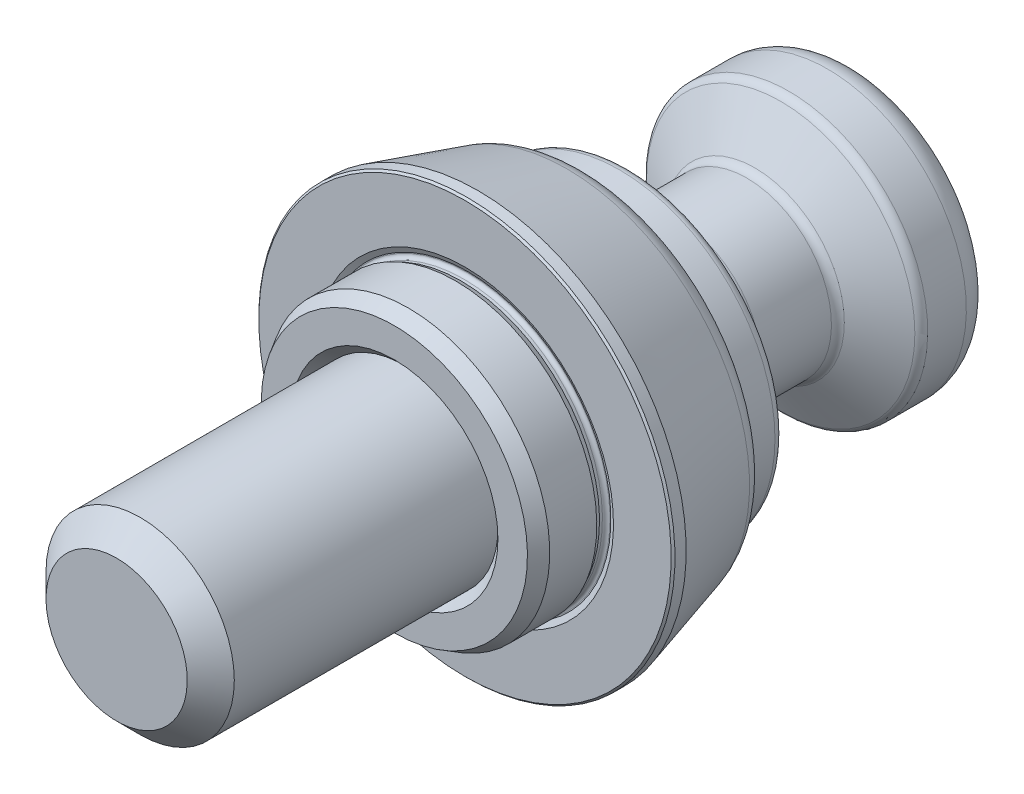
ISO-10303-21;
HEADER;
FILE_DESCRIPTION(('STEP AP214'),'2;1');
FILE_NAME('part.step','',(''),(''),'','','');
FILE_SCHEMA(('AUTOMOTIVE_DESIGN { 1 0 10303 214 1 1 1 1 }'));
ENDSEC;
DATA;
#1=APPLICATION_CONTEXT('core data for automotive mechanical design processes');
#2=APPLICATION_PROTOCOL_DEFINITION('international standard','automotive_design',2000,#1);
#3=PRODUCT_CONTEXT('',#1,'mechanical');
#4=PRODUCT('Part','Part','',(#3));
#5=PRODUCT_RELATED_PRODUCT_CATEGORY('part','',(#4));
#6=PRODUCT_DEFINITION_FORMATION('','',#4);
#7=PRODUCT_DEFINITION_CONTEXT('part definition',#1,'design');
#8=PRODUCT_DEFINITION('design','',#6,#7);
#9=PRODUCT_DEFINITION_SHAPE('','',#8);
#10=(LENGTH_UNIT() NAMED_UNIT(*) SI_UNIT(.MILLI.,.METRE.));
#11=(NAMED_UNIT(*) PLANE_ANGLE_UNIT() SI_UNIT($,.RADIAN.));
#12=(NAMED_UNIT(*) SI_UNIT($,.STERADIAN.) SOLID_ANGLE_UNIT());
#13=UNCERTAINTY_MEASURE_WITH_UNIT(LENGTH_MEASURE(1.E-05),#10,'distance_accuracy_value','');
#14=(GEOMETRIC_REPRESENTATION_CONTEXT(3) GLOBAL_UNCERTAINTY_ASSIGNED_CONTEXT((#13)) GLOBAL_UNIT_ASSIGNED_CONTEXT((#10,
#11,#12)) REPRESENTATION_CONTEXT('',''));
#15=CARTESIAN_POINT('',(0.,0.,0.));
#16=DIRECTION('',(0.,0.,1.));
#17=DIRECTION('',(1.,0.,0.));
#18=AXIS2_PLACEMENT_3D('',#15,#16,#17);
#19=CARTESIAN_POINT('',(15.1,0.,-0.3));
#20=DIRECTION('',(0.,0.,-1.));
#21=DIRECTION('',(0.,1.,0.));
#22=AXIS2_PLACEMENT_3D('',#19,#20,#21);
#23=PLANE('',#22);
#24=CARTESIAN_POINT('',(0.,0.,-0.3));
#25=DIRECTION('',(0.,0.,-1.));
#26=DIRECTION('',(0.,1.,0.));
#27=AXIS2_PLACEMENT_3D('',#24,#25,#26);
#28=CIRCLE('',#27,15.1978793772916);
#29=CARTESIAN_POINT('',(0.,15.1978793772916,-0.3));
#30=VERTEX_POINT('',#29);
#31=EDGE_CURVE('E582',#30,#30,#28,.T.);
#32=ORIENTED_EDGE('',*,*,#31,.F.);
#33=EDGE_LOOP('',(#32));
#34=FACE_BOUND('',#33,.T.);
#35=CARTESIAN_POINT('',(0.,0.,-0.3));
#36=DIRECTION('',(0.,0.,-1.));
#37=DIRECTION('',(0.,1.,0.));
#38=AXIS2_PLACEMENT_3D('',#35,#36,#37);
#39=CIRCLE('',#38,15.1);
#40=CARTESIAN_POINT('',(0.,15.1,-0.3));
#41=VERTEX_POINT('',#40);
#42=EDGE_CURVE('E585',#41,#41,#39,.T.);
#43=ORIENTED_EDGE('',*,*,#42,.T.);
#44=EDGE_LOOP('',(#43));
#45=FACE_BOUND('',#44,.T.);
#46=ADVANCED_FACE('F14',(#34,#45),#23,.F.);
#47=CARTESIAN_POINT('',(0.,0.,0.1));
#48=DIRECTION('',(0.,0.,-1.));
#49=DIRECTION('',(0.,1.,0.));
#50=AXIS2_PLACEMENT_3D('',#47,#48,#49);
#51=TOROIDAL_SURFACE('',#50,15.1,0.4);
#52=ORIENTED_EDGE('',*,*,#42,.F.);
#53=EDGE_LOOP('',(#52));
#54=FACE_BOUND('',#53,.T.);
#55=CARTESIAN_POINT('',(0.,0.,0.1));
#56=DIRECTION('',(0.,0.,-1.));
#57=DIRECTION('',(0.,1.,0.));
#58=AXIS2_PLACEMENT_3D('',#55,#56,#57);
#59=CIRCLE('',#58,14.7);
#60=CARTESIAN_POINT('',(0.,14.7,0.1));
#61=VERTEX_POINT('',#60);
#62=EDGE_CURVE('E586',#61,#61,#59,.T.);
#63=ORIENTED_EDGE('',*,*,#62,.T.);
#64=EDGE_LOOP('',(#63));
#65=FACE_BOUND('',#64,.T.);
#66=ADVANCED_FACE('F543',(#54,#65),#51,.F.);
#67=CARTESIAN_POINT('',(0.,0.,0.));
#68=DIRECTION('',(0.,0.,-1.));
#69=DIRECTION('',(0.,1.,0.));
#70=AXIS2_PLACEMENT_3D('',#67,#68,#69);
#71=CYLINDRICAL_SURFACE('',#70,14.7);
#72=ORIENTED_EDGE('',*,*,#62,.F.);
#73=EDGE_LOOP('',(#72));
#74=FACE_BOUND('',#73,.T.);
#75=CARTESIAN_POINT('',(0.,0.,0.411216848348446));
#76=DIRECTION('',(0.,0.,-1.));
#77=DIRECTION('',(0.,1.,0.));
#78=AXIS2_PLACEMENT_3D('',#75,#76,#77);
#79=CIRCLE('',#78,14.7);
#80=CARTESIAN_POINT('',(0.,14.7,0.411216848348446));
#81=VERTEX_POINT('',#80);
#82=EDGE_CURVE('E589',#81,#81,#79,.T.);
#83=ORIENTED_EDGE('',*,*,#82,.T.);
#84=EDGE_LOOP('',(#83));
#85=FACE_BOUND('',#84,.T.);
#86=ADVANCED_FACE('F534',(#74,#85),#71,.T.);
#87=CARTESIAN_POINT('',(0.,0.,1.));
#88=DIRECTION('',(0.,0.,1.));
#89=DIRECTION('',(0.,-1.,0.));
#90=AXIS2_PLACEMENT_3D('',#87,#88,#89);
#91=CONICAL_SURFACE('',#90,15.,0.471238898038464);
#92=ORIENTED_EDGE('',*,*,#82,.F.);
#93=EDGE_LOOP('',(#92));
#94=FACE_BOUND('',#93,.T.);
#95=CARTESIAN_POINT('',(0.,0.,1.));
#96=DIRECTION('',(0.,0.,-1.));
#97=DIRECTION('',(0.,1.,0.));
#98=AXIS2_PLACEMENT_3D('',#95,#96,#97);
#99=CIRCLE('',#98,15.);
#100=CARTESIAN_POINT('',(0.,15.,1.));
#101=VERTEX_POINT('',#100);
#102=EDGE_CURVE('E596',#101,#101,#99,.T.);
#103=ORIENTED_EDGE('',*,*,#102,.T.);
#104=EDGE_LOOP('',(#103));
#105=FACE_BOUND('',#104,.T.);
#106=ADVANCED_FACE('F525',(#94,#105),#91,.T.);
#107=CARTESIAN_POINT('',(0.,0.,0.));
#108=DIRECTION('',(0.,0.,-1.));
#109=DIRECTION('',(0.,1.,0.));
#110=AXIS2_PLACEMENT_3D('',#107,#108,#109);
#111=CYLINDRICAL_SURFACE('',#110,15.);
#112=ORIENTED_EDGE('',*,*,#102,.F.);
#113=EDGE_LOOP('',(#112));
#114=FACE_BOUND('',#113,.T.);
#115=CARTESIAN_POINT('',(0.,0.,6.));
#116=DIRECTION('',(0.,0.,1.));
#117=DIRECTION('',(0.,-1.,0.));
#118=AXIS2_PLACEMENT_3D('',#115,#116,#117);
#119=CIRCLE('',#118,15.);
#120=CARTESIAN_POINT('',(0.,-15.,6.));
#121=VERTEX_POINT('',#120);
#122=EDGE_CURVE('E608',#121,#121,#119,.F.);
#123=ORIENTED_EDGE('',*,*,#122,.T.);
#124=EDGE_LOOP('',(#123));
#125=FACE_BOUND('',#124,.T.);
#126=ADVANCED_FACE('F516',(#114,#125),#111,.T.);
#127=CARTESIAN_POINT('',(0.,0.,6.));
#128=DIRECTION('',(0.,0.,-1.));
#129=DIRECTION('',(0.,1.,0.));
#130=AXIS2_PLACEMENT_3D('',#127,#128,#129);
#131=CONICAL_SURFACE('',#130,15.,0.523598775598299);
#132=CARTESIAN_POINT('',(0.,0.,7.5));
#133=DIRECTION('',(0.,0.,1.));
#134=DIRECTION('',(0.,-1.,0.));
#135=AXIS2_PLACEMENT_3D('',#132,#133,#134);
#136=CIRCLE('',#135,14.1339745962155);
#137=CARTESIAN_POINT('',(0.,-14.1339745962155,7.5));
#138=VERTEX_POINT('',#137);
#139=EDGE_CURVE('E611',#138,#138,#136,.T.);
#140=ORIENTED_EDGE('',*,*,#139,.F.);
#141=EDGE_LOOP('',(#140));
#142=FACE_BOUND('',#141,.T.);
#143=ORIENTED_EDGE('',*,*,#122,.F.);
#144=EDGE_LOOP('',(#143));
#145=FACE_BOUND('',#144,.T.);
#146=ADVANCED_FACE('F507',(#142,#145),#131,.T.);
#147=CARTESIAN_POINT('',(10.,0.,7.5));
#148=DIRECTION('',(0.,0.,1.));
#149=DIRECTION('',(0.,-1.,0.));
#150=AXIS2_PLACEMENT_3D('',#147,#148,#149);
#151=PLANE('',#150);
#152=CARTESIAN_POINT('',(0.,0.,7.5));
#153=DIRECTION('',(0.,0.,1.));
#154=DIRECTION('',(0.,-1.,0.));
#155=AXIS2_PLACEMENT_3D('',#152,#153,#154);
#156=CIRCLE('',#155,11.);
#157=CARTESIAN_POINT('',(0.,-11.,7.5));
#158=VERTEX_POINT('',#157);
#159=EDGE_CURVE('E614',#158,#158,#156,.F.);
#160=ORIENTED_EDGE('',*,*,#159,.T.);
#161=EDGE_LOOP('',(#160));
#162=FACE_BOUND('',#161,.T.);
#163=ORIENTED_EDGE('',*,*,#139,.T.);
#164=EDGE_LOOP('',(#163));
#165=FACE_BOUND('',#164,.T.);
#166=ADVANCED_FACE('F499',(#162,#165),#151,.T.);
#167=CARTESIAN_POINT('',(0.,0.,7.5));
#168=DIRECTION('',(0.,0.,1.));
#169=DIRECTION('',(0.,-1.,0.));
#170=AXIS2_PLACEMENT_3D('',#167,#168,#169);
#171=CONICAL_SURFACE('',#170,11.,0.785398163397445);
#172=CARTESIAN_POINT('',(0.,0.,6.5));
#173=DIRECTION('',(0.,0.,1.));
#174=DIRECTION('',(0.,-1.,0.));
#175=AXIS2_PLACEMENT_3D('',#172,#173,#174);
#176=CIRCLE('',#175,10.);
#177=CARTESIAN_POINT('',(0.,-10.,6.5));
#178=VERTEX_POINT('',#177);
#179=EDGE_CURVE('E617',#178,#178,#176,.T.);
#180=ORIENTED_EDGE('',*,*,#179,.F.);
#181=EDGE_LOOP('',(#180));
#182=FACE_BOUND('',#181,.T.);
#183=ORIENTED_EDGE('',*,*,#159,.F.);
#184=EDGE_LOOP('',(#183));
#185=FACE_BOUND('',#184,.T.);
#186=ADVANCED_FACE('F490',(#182,#185),#171,.F.);
#187=CARTESIAN_POINT('',(0.,0.,-0.3));
#188=DIRECTION('',(0.,0.,1.));
#189=DIRECTION('',(0.,-1.,0.));
#190=AXIS2_PLACEMENT_3D('',#187,#188,#189);
#191=CONICAL_SURFACE('',#190,15.1978793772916,1.09083078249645);
#192=CARTESIAN_POINT('',(0.,0.,0.));
#193=DIRECTION('',(0.,0.,-1.));
#194=DIRECTION('',(0.,1.,0.));
#195=AXIS2_PLACEMENT_3D('',#192,#193,#194);
#196=CIRCLE('',#195,15.774174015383);
#197=CARTESIAN_POINT('',(0.,15.774174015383,0.));
#198=VERTEX_POINT('',#197);
#199=EDGE_CURVE('E82',#198,#198,#196,.T.);
#200=ORIENTED_EDGE('',*,*,#199,.F.);
#201=EDGE_LOOP('',(#200));
#202=FACE_BOUND('',#201,.T.);
#203=ORIENTED_EDGE('',*,*,#31,.T.);
#204=EDGE_LOOP('',(#203));
#205=FACE_BOUND('',#204,.T.);
#206=ADVANCED_FACE('F481',(#202,#205),#191,.F.);
#207=CARTESIAN_POINT('',(15.,0.,0.));
#208=DIRECTION('',(0.,0.,1.));
#209=DIRECTION('',(0.,-1.,0.));
#210=AXIS2_PLACEMENT_3D('',#207,#208,#209);
#211=PLANE('',#210);
#212=ORIENTED_EDGE('',*,*,#199,.T.);
#213=EDGE_LOOP('',(#212));
#214=FACE_BOUND('',#213,.T.);
#215=CARTESIAN_POINT('',(0.,0.,0.));
#216=DIRECTION('',(0.,0.,1.));
#217=DIRECTION('',(0.,-1.,0.));
#218=AXIS2_PLACEMENT_3D('',#215,#216,#217);
#219=CIRCLE('',#218,21.9);
#220=CARTESIAN_POINT('',(0.,-21.9,0.));
#221=VERTEX_POINT('',#220);
#222=EDGE_CURVE('E29',#221,#221,#219,.T.);
#223=ORIENTED_EDGE('',*,*,#222,.T.);
#224=EDGE_LOOP('',(#223));
#225=FACE_BOUND('',#224,.T.);
#226=ADVANCED_FACE('F473',(#214,#225),#211,.T.);
#227=CARTESIAN_POINT('',(0.,0.,-0.199999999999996));
#228=DIRECTION('',(0.,0.,-1.));
#229=DIRECTION('',(0.,1.,0.));
#230=AXIS2_PLACEMENT_3D('',#227,#228,#229);
#231=CONICAL_SURFACE('',#230,22.1,0.785398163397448);
#232=ORIENTED_EDGE('',*,*,#222,.F.);
#233=EDGE_LOOP('',(#232));
#234=FACE_BOUND('',#233,.T.);
#235=CARTESIAN_POINT('',(0.,0.,-0.199999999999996));
#236=DIRECTION('',(0.,0.,1.));
#237=DIRECTION('',(0.,-1.,0.));
#238=AXIS2_PLACEMENT_3D('',#235,#236,#237);
#239=CIRCLE('',#238,22.1);
#240=CARTESIAN_POINT('',(0.,-22.1,-0.199999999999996));
#241=VERTEX_POINT('',#240);
#242=EDGE_CURVE('E620',#241,#241,#239,.F.);
#243=ORIENTED_EDGE('',*,*,#242,.F.);
#244=EDGE_LOOP('',(#243));
#245=FACE_BOUND('',#244,.T.);
#246=ADVANCED_FACE('F231',(#234,#245),#231,.T.);
#247=CARTESIAN_POINT('',(0.,0.,0.));
#248=DIRECTION('',(0.,0.,-1.));
#249=DIRECTION('',(0.,1.,0.));
#250=AXIS2_PLACEMENT_3D('',#247,#248,#249);
#251=CYLINDRICAL_SURFACE('',#250,22.1);
#252=ORIENTED_EDGE('',*,*,#242,.T.);
#253=EDGE_LOOP('',(#252));
#254=FACE_BOUND('',#253,.T.);
#255=CARTESIAN_POINT('',(0.,0.,-1.3949657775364));
#256=DIRECTION('',(0.,0.,-1.));
#257=DIRECTION('',(0.,1.,0.));
#258=AXIS2_PLACEMENT_3D('',#255,#256,#257);
#259=CIRCLE('',#258,22.1);
#260=CARTESIAN_POINT('',(0.,22.1,-1.3949657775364));
#261=VERTEX_POINT('',#260);
#262=EDGE_CURVE('E599',#261,#261,#259,.T.);
#263=ORIENTED_EDGE('',*,*,#262,.F.);
#264=EDGE_LOOP('',(#263));
#265=FACE_BOUND('',#264,.T.);
#266=ADVANCED_FACE('F456',(#254,#265),#251,.T.);
#267=CARTESIAN_POINT('',(0.,0.,-13.));
#268=DIRECTION('',(0.,0.,1.));
#269=DIRECTION('',(0.,-1.,0.));
#270=AXIS2_PLACEMENT_3D('',#267,#268,#269);
#271=CONICAL_SURFACE('',#270,18.7723099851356,0.279252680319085);
#272=CARTESIAN_POINT('',(0.,0.,-10.826912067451));
#273=DIRECTION('',(0.,0.,-1.));
#274=DIRECTION('',(0.,1.,0.));
#275=AXIS2_PLACEMENT_3D('',#272,#273,#274);
#276=CIRCLE('',#275,19.3954329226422);
#277=CARTESIAN_POINT('',(0.,19.3954329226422,-10.826912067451));
#278=VERTEX_POINT('',#277);
#279=EDGE_CURVE('E605',#278,#278,#276,.F.);
#280=ORIENTED_EDGE('',*,*,#279,.T.);
#281=EDGE_LOOP('',(#280));
#282=FACE_BOUND('',#281,.T.);
#283=ORIENTED_EDGE('',*,*,#262,.T.);
#284=EDGE_LOOP('',(#283));
#285=FACE_BOUND('',#284,.T.);
#286=ADVANCED_FACE('F447',(#282,#285),#271,.T.);
#287=CARTESIAN_POINT('',(0.,0.,-10.));
#288=DIRECTION('',(0.,0.,-1.));
#289=DIRECTION('',(0.,1.,0.));
#290=AXIS2_PLACEMENT_3D('',#287,#288,#289);
#291=TOROIDAL_SURFACE('',#290,16.5116478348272,3.);
#292=ORIENTED_EDGE('',*,*,#279,.F.);
#293=EDGE_LOOP('',(#292));
#294=FACE_BOUND('',#293,.T.);
#295=CARTESIAN_POINT('',(0.,0.,-13.));
#296=DIRECTION('',(0.,0.,-1.));
#297=DIRECTION('',(0.,1.,0.));
#298=AXIS2_PLACEMENT_3D('',#295,#296,#297);
#299=CIRCLE('',#298,16.5116478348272);
#300=CARTESIAN_POINT('',(0.,16.5116478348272,-13.));
#301=VERTEX_POINT('',#300);
#302=EDGE_CURVE('E602',#301,#301,#299,.T.);
#303=ORIENTED_EDGE('',*,*,#302,.F.);
#304=EDGE_LOOP('',(#303));
#305=FACE_BOUND('',#304,.T.);
#306=ADVANCED_FACE('F438',(#294,#305),#291,.T.);
#307=CARTESIAN_POINT('',(10.,0.,-13.));
#308=DIRECTION('',(0.,0.,-1.));
#309=DIRECTION('',(0.,1.,0.));
#310=AXIS2_PLACEMENT_3D('',#307,#308,#309);
#311=PLANE('',#310);
#312=CARTESIAN_POINT('',(0.,0.,-13.));
#313=DIRECTION('',(0.,0.,-1.));
#314=DIRECTION('',(-1.,0.,0.));
#315=AXIS2_PLACEMENT_3D('',#312,#313,#314);
#316=CIRCLE('',#315,16.);
#317=CARTESIAN_POINT('',(-16.,0.,-13.));
#318=VERTEX_POINT('',#317);
#319=EDGE_CURVE('E9',#318,#318,#316,.T.);
#320=ORIENTED_EDGE('',*,*,#319,.F.);
#321=EDGE_LOOP('',(#320));
#322=FACE_BOUND('',#321,.T.);
#323=ORIENTED_EDGE('',*,*,#302,.T.);
#324=EDGE_LOOP('',(#323));
#325=FACE_BOUND('',#324,.T.);
#326=ADVANCED_FACE('F152',(#322,#325),#311,.T.);
#327=CARTESIAN_POINT('',(0.,0.,37.));
#328=DIRECTION('',(0.,0.,1.));
#329=DIRECTION('',(0.,1.,0.));
#330=AXIS2_PLACEMENT_3D('',#327,#328,#329);
#331=PLANE('',#330);
#332=CARTESIAN_POINT('',(0.,0.,37.));
#333=DIRECTION('',(0.,0.,1.));
#334=DIRECTION('',(0.,1.,0.));
#335=AXIS2_PLACEMENT_3D('',#332,#333,#334);
#336=CIRCLE('',#335,7.5);
#337=CARTESIAN_POINT('',(0.,7.5,37.));
#338=VERTEX_POINT('',#337);
#339=EDGE_CURVE('E129',#338,#338,#336,.T.);
#340=ORIENTED_EDGE('',*,*,#339,.T.);
#341=EDGE_LOOP('',(#340));
#342=FACE_BOUND('',#341,.T.);
#343=ADVANCED_FACE('F164',(#342),#331,.T.);
#344=CARTESIAN_POINT('',(0.,0.,34.5));
#345=DIRECTION('',(0.,0.,-1.));
#346=DIRECTION('',(0.,-1.,0.));
#347=AXIS2_PLACEMENT_3D('',#344,#345,#346);
#348=CONICAL_SURFACE('',#347,10.,0.78539816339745);
#349=ORIENTED_EDGE('',*,*,#339,.F.);
#350=EDGE_LOOP('',(#349));
#351=FACE_BOUND('',#350,.T.);
#352=CARTESIAN_POINT('',(0.,0.,34.5));
#353=DIRECTION('',(0.,0.,1.));
#354=DIRECTION('',(0.,1.,0.));
#355=AXIS2_PLACEMENT_3D('',#352,#353,#354);
#356=CIRCLE('',#355,10.);
#357=CARTESIAN_POINT('',(0.,10.,34.5));
#358=VERTEX_POINT('',#357);
#359=EDGE_CURVE('E126',#358,#358,#356,.F.);
#360=ORIENTED_EDGE('',*,*,#359,.F.);
#361=EDGE_LOOP('',(#360));
#362=FACE_BOUND('',#361,.T.);
#363=ADVANCED_FACE('F161',(#351,#362),#348,.T.);
#364=CARTESIAN_POINT('',(0.,0.,-13.));
#365=DIRECTION('',(0.,0.,-1.));
#366=DIRECTION('',(0.,-1.,0.));
#367=AXIS2_PLACEMENT_3D('',#364,#365,#366);
#368=CYLINDRICAL_SURFACE('',#367,10.);
#369=ORIENTED_EDGE('',*,*,#359,.T.);
#370=EDGE_LOOP('',(#369));
#371=FACE_BOUND('',#370,.T.);
#372=ORIENTED_EDGE('',*,*,#179,.T.);
#373=EDGE_LOOP('',(#372));
#374=FACE_BOUND('',#373,.T.);
#375=ADVANCED_FACE('F163',(#371,#374),#368,.T.);
#376=CARTESIAN_POINT('',(0.,0.,-36.));
#377=DIRECTION('',(0.,0.,-1.));
#378=DIRECTION('',(0.,-1.,0.));
#379=AXIS2_PLACEMENT_3D('',#376,#377,#378);
#380=PLANE('',#379);
#381=DIRECTION('',(-0.5,-0.866025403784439,0.));
#382=VECTOR('',#381,1.);
#383=CARTESIAN_POINT('',(4.61880215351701,0.,-36.));
#384=LINE('',#383,#382);
#385=CARTESIAN_POINT('',(4.61880215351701,0.,-36.));
#386=VERTEX_POINT('',#385);
#387=CARTESIAN_POINT('',(2.30940107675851,-4.,-36.));
#388=VERTEX_POINT('',#387);
#389=EDGE_CURVE('E98',#386,#388,#384,.T.);
#390=ORIENTED_EDGE('',*,*,#389,.T.);
#391=DIRECTION('',(-1.,0.,0.));
#392=VECTOR('',#391,1.);
#393=CARTESIAN_POINT('',(2.30940107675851,-4.,-36.));
#394=LINE('',#393,#392);
#395=CARTESIAN_POINT('',(-2.30940107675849,-4.,-36.));
#396=VERTEX_POINT('',#395);
#397=EDGE_CURVE('E94',#388,#396,#394,.T.);
#398=ORIENTED_EDGE('',*,*,#397,.T.);
#399=DIRECTION('',(-0.5,0.866025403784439,0.));
#400=VECTOR('',#399,1.);
#401=CARTESIAN_POINT('',(-2.30940107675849,-4.,-36.));
#402=LINE('',#401,#400);
#403=CARTESIAN_POINT('',(-4.61880215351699,0.,-36.));
#404=VERTEX_POINT('',#403);
#405=EDGE_CURVE('E45',#396,#404,#402,.T.);
#406=ORIENTED_EDGE('',*,*,#405,.T.);
#407=DIRECTION('',(0.5,0.866025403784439,0.));
#408=VECTOR('',#407,1.);
#409=CARTESIAN_POINT('',(-4.61880215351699,0.,-36.));
#410=LINE('',#409,#408);
#411=CARTESIAN_POINT('',(-2.30940107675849,4.,-36.));
#412=VERTEX_POINT('',#411);
#413=EDGE_CURVE('E92',#404,#412,#410,.T.);
#414=ORIENTED_EDGE('',*,*,#413,.T.);
#415=DIRECTION('',(1.,0.,0.));
#416=VECTOR('',#415,1.);
#417=CARTESIAN_POINT('',(-2.30940107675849,4.,-36.));
#418=LINE('',#417,#416);
#419=CARTESIAN_POINT('',(2.30940107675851,4.,-36.));
#420=VERTEX_POINT('',#419);
#421=EDGE_CURVE('E292',#412,#420,#418,.T.);
#422=ORIENTED_EDGE('',*,*,#421,.T.);
#423=DIRECTION('',(0.5,-0.866025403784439,0.));
#424=VECTOR('',#423,1.);
#425=CARTESIAN_POINT('',(2.30940107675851,4.,-36.));
#426=LINE('',#425,#424);
#427=EDGE_CURVE('E280',#420,#386,#426,.T.);
#428=ORIENTED_EDGE('',*,*,#427,.T.);
#429=EDGE_LOOP('',(#390,#398,#406,#414,#422,#428));
#430=FACE_BOUND('',#429,.T.);
#431=ADVANCED_FACE('F156',(#430),#380,.T.);
#432=CARTESIAN_POINT('',(-4.61880215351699,0.,-36.));
#433=DIRECTION('',(-0.866025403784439,0.5,0.));
#434=DIRECTION('',(-0.5,-0.866025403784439,0.));
#435=AXIS2_PLACEMENT_3D('',#432,#433,#434);
#436=PLANE('',#435);
#437=CARTESIAN_POINT('',(-2.30928560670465,4.0002,-41.2799819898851));
#438=CARTESIAN_POINT('',(-2.41077174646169,3.82442084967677,-41.2213676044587));
#439=CARTESIAN_POINT('',(-2.51313390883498,3.64712438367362,-41.1680600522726));
#440=CARTESIAN_POINT('',(-2.7196307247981,3.28946140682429,-41.0750114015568));
#441=CARTESIAN_POINT('',(-2.82376904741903,3.10908854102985,-41.0353032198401));
#442=CARTESIAN_POINT('',(-3.03075510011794,2.75057818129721,-40.9734919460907));
#443=CARTESIAN_POINT('',(-3.1335709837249,2.57249584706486,-40.9509774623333));
#444=CARTESIAN_POINT('',(-3.33968651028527,2.21549328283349,-40.924100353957));
#445=CARTESIAN_POINT('',(-3.44298540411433,2.0365743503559,-40.9197154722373));
#446=CARTESIAN_POINT('',(-3.63600352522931,1.70225715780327,-40.9288398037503));
#447=CARTESIAN_POINT('',(-3.72575165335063,1.54680884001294,-40.9401086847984));
#448=CARTESIAN_POINT('',(-3.90466320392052,1.23692494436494,-40.9758237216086));
#449=CARTESIAN_POINT('',(-3.99382600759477,1.08249043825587,-41.0002820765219));
#450=CARTESIAN_POINT('',(-4.17310641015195,0.771967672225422,-41.0614257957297));
#451=CARTESIAN_POINT('',(-4.2632013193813,0.615918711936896,-41.0983703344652));
#452=CARTESIAN_POINT('',(-4.44204742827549,0.306148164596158,-41.1822198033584));
#453=CARTESIAN_POINT('',(-4.53080091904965,0.152422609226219,-41.2291050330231));
#454=CARTESIAN_POINT('',(-4.61891762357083,-0.000200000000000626,-41.2799819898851));
#455=B_SPLINE_CURVE_WITH_KNOTS('',3,(#437,#438,#439,#440,#441,#442,#443,#444,#445,#446,#447,
#448,#449,#450,#451,#452,#453,#454),.UNSPECIFIED.,.F.,.F.,(4,2,2,2,2,2,2,2,4),(0.,
0.634047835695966,1.26961969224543,1.88946157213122,2.50854226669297,3.04757825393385,
3.58711366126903,4.13861653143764,4.68903648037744),.UNSPECIFIED.);
#456=CARTESIAN_POINT('',(-2.30940107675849,4.,-41.2799153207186));
#457=VERTEX_POINT('',#456);
#458=CARTESIAN_POINT('',(-4.61880215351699,0.,-41.2799153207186));
#459=VERTEX_POINT('',#458);
#460=EDGE_CURVE('E18',#457,#459,#455,.T.);
#461=ORIENTED_EDGE('',*,*,#460,.F.);
#462=DIRECTION('',(0.,0.,-1.));
#463=VECTOR('',#462,1.);
#464=CARTESIAN_POINT('',(-2.30940107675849,4.,-36.));
#465=LINE('',#464,#463);
#466=EDGE_CURVE('E93',#412,#457,#465,.T.);
#467=ORIENTED_EDGE('',*,*,#466,.F.);
#468=ORIENTED_EDGE('',*,*,#413,.F.);
#469=DIRECTION('',(0.,0.,-1.));
#470=VECTOR('',#469,1.);
#471=CARTESIAN_POINT('',(-4.61880215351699,0.,-36.));
#472=LINE('',#471,#470);
#473=EDGE_CURVE('E85',#404,#459,#472,.T.);
#474=ORIENTED_EDGE('',*,*,#473,.T.);
#475=EDGE_LOOP('',(#461,#467,#468,#474));
#476=FACE_BOUND('',#475,.T.);
#477=ADVANCED_FACE('F90',(#476),#436,.F.);
#478=CARTESIAN_POINT('',(-2.30940107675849,4.,-36.));
#479=DIRECTION('',(0.,1.,0.));
#480=DIRECTION('',(-1.,0.,0.));
#481=AXIS2_PLACEMENT_3D('',#478,#479,#480);
#482=PLANE('',#481);
#483=CARTESIAN_POINT('',(6.12487198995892,4.,-42.836756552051));
#484=CARTESIAN_POINT('',(5.95080040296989,4.,-42.7526348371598));
#485=CARTESIAN_POINT('',(5.77632066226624,4.,-42.6693427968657));
#486=CARTESIAN_POINT('',(5.42632749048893,4.,-42.5048863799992));
#487=CARTESIAN_POINT('',(5.25081389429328,4.,-42.4237223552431));
#488=CARTESIAN_POINT('',(4.89759312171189,4.,-42.2635650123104));
#489=CARTESIAN_POINT('',(4.71987914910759,4.,-42.1845866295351));
#490=CARTESIAN_POINT('',(4.36300984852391,4.,-42.0299688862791));
#491=CARTESIAN_POINT('',(4.18385459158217,4.,-41.9543293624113));
#492=CARTESIAN_POINT('',(3.81836249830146,4.,-41.8050453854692));
#493=CARTESIAN_POINT('',(3.63197240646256,4.,-41.7315305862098));
#494=CARTESIAN_POINT('',(3.25698279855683,4.,-41.5902573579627));
#495=CARTESIAN_POINT('',(3.06838303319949,4.,-41.5224995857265));
#496=CARTESIAN_POINT('',(2.68905319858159,4.,-41.3945768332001));
#497=CARTESIAN_POINT('',(2.49832860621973,4.,-41.3343957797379));
#498=CARTESIAN_POINT('',(2.11414547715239,4.,-41.2236090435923));
#499=CARTESIAN_POINT('',(1.92068784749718,4.,-41.1730002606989));
#500=CARTESIAN_POINT('',(1.53197854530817,4.,-41.0841001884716));
#501=CARTESIAN_POINT('',(1.33674161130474,4.,-41.0457456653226));
#502=CARTESIAN_POINT('',(0.943924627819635,4.,-40.9835785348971));
#503=CARTESIAN_POINT('',(0.74634477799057,4.,-40.9597646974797));
#504=CARTESIAN_POINT('',(0.352375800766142,4.,-40.928891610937));
#505=CARTESIAN_POINT('',(0.156003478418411,4.,-40.9216231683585));
#506=CARTESIAN_POINT('',(-0.236656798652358,4.,-40.9239110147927));
#507=CARTESIAN_POINT('',(-0.432944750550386,4.,-40.9334678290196));
#508=CARTESIAN_POINT('',(-0.768552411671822,4.,-40.9635277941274));
#509=CARTESIAN_POINT('',(-0.908238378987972,4.,-40.9801571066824));
#510=CARTESIAN_POINT('',(-1.18652950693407,4.,-41.0208577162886));
#511=CARTESIAN_POINT('',(-1.32513450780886,4.,-41.0449300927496));
#512=CARTESIAN_POINT('',(-1.73917566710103,4.,-41.1270402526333));
#513=CARTESIAN_POINT('',(-2.01267191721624,4.,-41.1949542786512));
#514=CARTESIAN_POINT('',(-2.42154611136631,4.,-41.3119809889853));
#515=CARTESIAN_POINT('',(-2.55906101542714,4.,-41.3540463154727));
#516=CARTESIAN_POINT('',(-2.83275383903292,4.,-41.442360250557));
#517=CARTESIAN_POINT('',(-2.96893174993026,4.,-41.4886088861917));
#518=CARTESIAN_POINT('',(-3.23999760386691,4.,-41.5845627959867));
#519=CARTESIAN_POINT('',(-3.37488599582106,4.,-41.6342668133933));
#520=CARTESIAN_POINT('',(-3.6435576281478,4.,-41.7365653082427));
#521=CARTESIAN_POINT('',(-3.77734087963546,4.,-41.7891597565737));
#522=CARTESIAN_POINT('',(-4.08532431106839,4.,-41.9134634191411));
#523=CARTESIAN_POINT('',(-4.2591749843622,4.,-41.986036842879));
#524=CARTESIAN_POINT('',(-4.60547274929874,4.,-42.134467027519));
#525=CARTESIAN_POINT('',(-4.77791976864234,4.,-42.2103239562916));
#526=CARTESIAN_POINT('',(-5.12166021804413,4.,-42.3646807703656));
#527=CARTESIAN_POINT('',(-5.29295344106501,4.,-42.4431811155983));
#528=CARTESIAN_POINT('',(-5.63454712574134,4.,-42.6023158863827));
#529=CARTESIAN_POINT('',(-5.80484756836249,4.,-42.6829503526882));
#530=CARTESIAN_POINT('',(-6.31480399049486,4.,-42.9275952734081));
#531=CARTESIAN_POINT('',(-6.6532105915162,4.,-43.0942087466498));
#532=CARTESIAN_POINT('',(-7.32764255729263,4.,-43.4321855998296));
#533=CARTESIAN_POINT('',(-7.66366784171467,4.,-43.6035491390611));
#534=CARTESIAN_POINT('',(-8.30719170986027,4.,-43.9358560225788));
#535=CARTESIAN_POINT('',(-8.61482523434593,4.,-44.0965385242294));
#536=CARTESIAN_POINT('',(-9.22895577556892,4.,-44.4200801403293));
#537=CARTESIAN_POINT('',(-9.53545275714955,4.,-44.5829393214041));
#538=CARTESIAN_POINT('',(-10.1468647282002,4.,-44.9099568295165));
#539=CARTESIAN_POINT('',(-10.4517817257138,4.,-45.0741114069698));
#540=CARTESIAN_POINT('',(-11.0608846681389,4.,-45.4037357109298));
#541=CARTESIAN_POINT('',(-11.3650706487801,4.,-45.5692053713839));
#542=CARTESIAN_POINT('',(-11.668985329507,4.,-45.7351683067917));
#543=B_SPLINE_CURVE_WITH_KNOTS('',3,(#483,#484,#485,#486,#487,#488,#489,#490,#491,#492,#493,
#494,#495,#496,#497,#498,#499,#500,#501,#502,#503,#504,#505,#506,#507,#508,#509,#510,#511,#512,
#513,#514,#515,#516,#517,#518,#519,#520,#521,#522,#523,#524,#525,#526,#527,#528,#529,#530,#531,
#532,#533,#534,#535,#536,#537,#538,#539,#540,#541,#542),.UNSPECIFIED.,.F.,.F.,(4,2,2,2,2,2,2,2,
2,2,2,2,2,2,2,2,2,2,2,2,2,2,2,2,2,2,2,2,2,4),(0.,0.580004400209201,1.16010409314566,
1.74349635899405,2.32686004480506,2.92787829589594,3.52896501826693,4.12875430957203,
4.72834901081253,5.32479777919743,5.92119608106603,6.51001085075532,7.09884400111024,
7.52065483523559,7.9425268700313,8.78676942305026,9.21814999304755,9.64953335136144,
10.0807606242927,10.5119835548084,11.0771101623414,11.642265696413,12.2075200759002,
12.7727852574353,13.9043188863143,15.0358905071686,16.0770876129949,17.1183166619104,
18.1572019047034,19.1960352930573),.UNSPECIFIED.);
#544=CARTESIAN_POINT('',(2.30940107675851,4.,-41.2799153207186));
#545=VERTEX_POINT('',#544);
#546=EDGE_CURVE('E37',#545,#457,#543,.T.);
#547=ORIENTED_EDGE('',*,*,#546,.F.);
#548=DIRECTION('',(0.,0.,-1.));
#549=VECTOR('',#548,1.);
#550=CARTESIAN_POINT('',(2.30940107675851,4.,-36.));
#551=LINE('',#550,#549);
#552=EDGE_CURVE('E96',#420,#545,#551,.T.);
#553=ORIENTED_EDGE('',*,*,#552,.F.);
#554=ORIENTED_EDGE('',*,*,#421,.F.);
#555=ORIENTED_EDGE('',*,*,#466,.T.);
#556=EDGE_LOOP('',(#547,#553,#554,#555));
#557=FACE_BOUND('',#556,.T.);
#558=ADVANCED_FACE('F265',(#557),#482,.F.);
#559=CARTESIAN_POINT('',(2.30940107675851,4.,-36.));
#560=DIRECTION('',(0.866025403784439,0.5,0.));
#561=DIRECTION('',(-0.5,0.866025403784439,0.));
#562=AXIS2_PLACEMENT_3D('',#559,#560,#561);
#563=PLANE('',#562);
#564=CARTESIAN_POINT('',(4.61891762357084,-0.000200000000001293,-41.2799819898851));
#565=CARTESIAN_POINT('',(4.5174314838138,0.175579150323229,-41.2213676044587));
#566=CARTESIAN_POINT('',(4.41506932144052,0.352875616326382,-41.1680600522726));
#567=CARTESIAN_POINT('',(4.2085725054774,0.710538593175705,-41.0750114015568));
#568=CARTESIAN_POINT('',(4.10443418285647,0.890911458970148,-41.0353032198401));
#569=CARTESIAN_POINT('',(3.89744813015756,1.24942181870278,-40.9734919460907));
#570=CARTESIAN_POINT('',(3.7946322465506,1.42750415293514,-40.9509774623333));
#571=CARTESIAN_POINT('',(3.58851671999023,1.7845067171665,-40.924100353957));
#572=CARTESIAN_POINT('',(3.48521782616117,1.96342564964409,-40.9197154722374));
#573=CARTESIAN_POINT('',(3.29219970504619,2.29774284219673,-40.9288398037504));
#574=CARTESIAN_POINT('',(3.20245157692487,2.45319115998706,-40.9401086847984));
#575=CARTESIAN_POINT('',(3.02354002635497,2.76307505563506,-40.9758237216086));
#576=CARTESIAN_POINT('',(2.93437722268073,2.91750956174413,-41.0002820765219));
#577=CARTESIAN_POINT('',(2.75509682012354,3.22803232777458,-41.0614257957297));
#578=CARTESIAN_POINT('',(2.6650019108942,3.3840812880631,-41.0983703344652));
#579=CARTESIAN_POINT('',(2.48615580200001,3.69385183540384,-41.1822198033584));
#580=CARTESIAN_POINT('',(2.39740231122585,3.84757739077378,-41.2291050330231));
#581=CARTESIAN_POINT('',(2.30928560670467,4.0002,-41.2799819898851));
#582=B_SPLINE_CURVE_WITH_KNOTS('',3,(#564,#565,#566,#567,#568,#569,#570,#571,#572,#573,#574,
#575,#576,#577,#578,#579,#580,#581),.UNSPECIFIED.,.F.,.F.,(4,2,2,2,2,2,2,2,4),(0.,
0.634047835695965,1.26961969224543,1.88946157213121,2.50854226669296,3.04757825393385,
3.58711366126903,4.13861653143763,4.68903648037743),.UNSPECIFIED.);
#583=CARTESIAN_POINT('',(4.61880215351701,0.,-41.2799153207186));
#584=VERTEX_POINT('',#583);
#585=EDGE_CURVE('E245',#584,#545,#582,.T.);
#586=ORIENTED_EDGE('',*,*,#585,.F.);
#587=DIRECTION('',(0.,0.,-1.));
#588=VECTOR('',#587,1.);
#589=CARTESIAN_POINT('',(4.61880215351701,0.,-36.));
#590=LINE('',#589,#588);
#591=EDGE_CURVE('E282',#386,#584,#590,.T.);
#592=ORIENTED_EDGE('',*,*,#591,.F.);
#593=ORIENTED_EDGE('',*,*,#427,.F.);
#594=ORIENTED_EDGE('',*,*,#552,.T.);
#595=EDGE_LOOP('',(#586,#592,#593,#594));
#596=FACE_BOUND('',#595,.T.);
#597=ADVANCED_FACE('F260',(#596),#563,.F.);
#598=CARTESIAN_POINT('',(4.61880215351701,0.,-36.));
#599=DIRECTION('',(0.866025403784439,-0.5,0.));
#600=DIRECTION('',(0.5,0.866025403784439,0.));
#601=AXIS2_PLACEMENT_3D('',#598,#599,#600);
#602=PLANE('',#601);
#603=CARTESIAN_POINT('',(2.30928560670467,-4.0002,-41.2799819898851));
#604=CARTESIAN_POINT('',(2.41077174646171,-3.82442084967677,-41.2213676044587));
#605=CARTESIAN_POINT('',(2.513133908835,-3.64712438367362,-41.1680600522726));
#606=CARTESIAN_POINT('',(2.71963072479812,-3.28946140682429,-41.0750114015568));
#607=CARTESIAN_POINT('',(2.82376904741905,-3.10908854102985,-41.0353032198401));
#608=CARTESIAN_POINT('',(3.03075510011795,-2.75057818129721,-40.9734919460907));
#609=CARTESIAN_POINT('',(3.13357098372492,-2.57249584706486,-40.9509774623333));
#610=CARTESIAN_POINT('',(3.33968651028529,-2.21549328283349,-40.924100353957));
#611=CARTESIAN_POINT('',(3.44298540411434,-2.0365743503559,-40.9197154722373));
#612=CARTESIAN_POINT('',(3.63600352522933,-1.70225715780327,-40.9288398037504));
#613=CARTESIAN_POINT('',(3.72575165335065,-1.54680884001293,-40.9401086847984));
#614=CARTESIAN_POINT('',(3.90466320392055,-1.23692494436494,-40.9758237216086));
#615=CARTESIAN_POINT('',(3.99382600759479,-1.08249043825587,-41.0002820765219));
#616=CARTESIAN_POINT('',(4.17310641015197,-0.771967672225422,-41.0614257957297));
#617=CARTESIAN_POINT('',(4.26320131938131,-0.6159187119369,-41.0983703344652));
#618=CARTESIAN_POINT('',(4.4420474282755,-0.306148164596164,-41.1822198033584));
#619=CARTESIAN_POINT('',(4.53080091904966,-0.152422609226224,-41.2291050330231));
#620=CARTESIAN_POINT('',(4.61891762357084,0.000199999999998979,-41.2799819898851));
#621=B_SPLINE_CURVE_WITH_KNOTS('',3,(#603,#604,#605,#606,#607,#608,#609,#610,#611,#612,#613,
#614,#615,#616,#617,#618,#619,#620),.UNSPECIFIED.,.F.,.F.,(4,2,2,2,2,2,2,2,4),(0.,
0.634047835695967,1.26961969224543,1.88946157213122,2.50854226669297,3.04757825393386,
3.58711366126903,4.13861653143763,4.68903648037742),.UNSPECIFIED.);
#622=CARTESIAN_POINT('',(2.30940107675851,-4.,-41.2799153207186));
#623=VERTEX_POINT('',#622);
#624=EDGE_CURVE('E251',#623,#584,#621,.T.);
#625=ORIENTED_EDGE('',*,*,#624,.F.);
#626=DIRECTION('',(0.,0.,-1.));
#627=VECTOR('',#626,1.);
#628=CARTESIAN_POINT('',(2.30940107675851,-4.,-36.));
#629=LINE('',#628,#627);
#630=EDGE_CURVE('E283',#388,#623,#629,.T.);
#631=ORIENTED_EDGE('',*,*,#630,.F.);
#632=ORIENTED_EDGE('',*,*,#389,.F.);
#633=ORIENTED_EDGE('',*,*,#591,.T.);
#634=EDGE_LOOP('',(#625,#631,#632,#633));
#635=FACE_BOUND('',#634,.T.);
#636=ADVANCED_FACE('F257',(#635),#602,.F.);
#637=CARTESIAN_POINT('',(2.30940107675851,-4.,-36.));
#638=DIRECTION('',(0.,-1.,0.));
#639=DIRECTION('',(1.,0.,0.));
#640=AXIS2_PLACEMENT_3D('',#637,#638,#639);
#641=PLANE('',#640);
#642=CARTESIAN_POINT('',(6.12487198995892,-4.,-42.836756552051));
#643=CARTESIAN_POINT('',(5.95080040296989,-4.,-42.7526348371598));
#644=CARTESIAN_POINT('',(5.77632066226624,-4.,-42.6693427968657));
#645=CARTESIAN_POINT('',(5.42632749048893,-4.,-42.5048863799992));
#646=CARTESIAN_POINT('',(5.25081389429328,-4.,-42.4237223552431));
#647=CARTESIAN_POINT('',(4.89759312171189,-4.,-42.2635650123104));
#648=CARTESIAN_POINT('',(4.7198791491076,-4.,-42.1845866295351));
#649=CARTESIAN_POINT('',(4.36300984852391,-4.,-42.0299688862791));
#650=CARTESIAN_POINT('',(4.18385459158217,-4.,-41.9543293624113));
#651=CARTESIAN_POINT('',(3.81836249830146,-4.,-41.8050453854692));
#652=CARTESIAN_POINT('',(3.63197240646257,-4.,-41.7315305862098));
#653=CARTESIAN_POINT('',(3.25698279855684,-4.,-41.5902573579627));
#654=CARTESIAN_POINT('',(3.06838303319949,-4.,-41.5224995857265));
#655=CARTESIAN_POINT('',(2.68905319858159,-4.,-41.3945768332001));
#656=CARTESIAN_POINT('',(2.49832860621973,-4.,-41.3343957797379));
#657=CARTESIAN_POINT('',(2.11414547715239,-4.,-41.2236090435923));
#658=CARTESIAN_POINT('',(1.92068784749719,-4.,-41.1730002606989));
#659=CARTESIAN_POINT('',(1.53197854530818,-4.,-41.0841001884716));
#660=CARTESIAN_POINT('',(1.33674161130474,-4.,-41.0457456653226));
#661=CARTESIAN_POINT('',(0.943924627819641,-4.,-40.9835785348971));
#662=CARTESIAN_POINT('',(0.746344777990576,-4.,-40.9597646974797));
#663=CARTESIAN_POINT('',(0.352375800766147,-4.,-40.928891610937));
#664=CARTESIAN_POINT('',(0.156003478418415,-4.,-40.9216231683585));
#665=CARTESIAN_POINT('',(-0.236656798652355,-4.,-40.9239110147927));
#666=CARTESIAN_POINT('',(-0.432944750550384,-4.,-40.9334678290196));
#667=CARTESIAN_POINT('',(-0.76855241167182,-4.,-40.9635277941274));
#668=CARTESIAN_POINT('',(-0.90823837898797,-4.,-40.9801571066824));
#669=CARTESIAN_POINT('',(-1.18652950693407,-4.,-41.0208577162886));
#670=CARTESIAN_POINT('',(-1.32513450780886,-4.,-41.0449300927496));
#671=CARTESIAN_POINT('',(-1.73917566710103,-4.,-41.1270402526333));
#672=CARTESIAN_POINT('',(-2.01267191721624,-4.,-41.1949542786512));
#673=CARTESIAN_POINT('',(-2.42154611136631,-4.,-41.3119809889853));
#674=CARTESIAN_POINT('',(-2.55906101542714,-4.,-41.3540463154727));
#675=CARTESIAN_POINT('',(-2.83275383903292,-4.,-41.442360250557));
#676=CARTESIAN_POINT('',(-2.96893174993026,-4.,-41.4886088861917));
#677=CARTESIAN_POINT('',(-3.23999760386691,-4.,-41.5845627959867));
#678=CARTESIAN_POINT('',(-3.37488599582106,-4.,-41.6342668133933));
#679=CARTESIAN_POINT('',(-3.64355762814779,-4.,-41.7365653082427));
#680=CARTESIAN_POINT('',(-3.77734087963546,-4.,-41.7891597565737));
#681=CARTESIAN_POINT('',(-4.08532431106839,-4.,-41.9134634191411));
#682=CARTESIAN_POINT('',(-4.25917498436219,-4.,-41.986036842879));
#683=CARTESIAN_POINT('',(-4.60547274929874,-4.,-42.134467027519));
#684=CARTESIAN_POINT('',(-4.77791976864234,-4.,-42.2103239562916));
#685=CARTESIAN_POINT('',(-5.12166021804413,-4.,-42.3646807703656));
#686=CARTESIAN_POINT('',(-5.29295344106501,-4.,-42.4431811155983));
#687=CARTESIAN_POINT('',(-5.63454712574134,-4.,-42.6023158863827));
#688=CARTESIAN_POINT('',(-5.80484756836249,-4.,-42.6829503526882));
#689=CARTESIAN_POINT('',(-6.31480399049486,-4.,-42.9275952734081));
#690=CARTESIAN_POINT('',(-6.6532105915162,-4.,-43.0942087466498));
#691=CARTESIAN_POINT('',(-7.32764255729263,-4.,-43.4321855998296));
#692=CARTESIAN_POINT('',(-7.66366784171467,-4.,-43.6035491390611));
#693=CARTESIAN_POINT('',(-8.30719170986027,-4.,-43.9358560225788));
#694=CARTESIAN_POINT('',(-8.61482523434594,-4.,-44.0965385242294));
#695=CARTESIAN_POINT('',(-9.22895577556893,-4.,-44.4200801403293));
#696=CARTESIAN_POINT('',(-9.53545275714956,-4.,-44.5829393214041));
#697=CARTESIAN_POINT('',(-10.1468647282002,-4.,-44.9099568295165));
#698=CARTESIAN_POINT('',(-10.4517817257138,-4.00000000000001,-45.0741114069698));
#699=CARTESIAN_POINT('',(-11.0608846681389,-4.00000000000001,-45.4037357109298));
#700=CARTESIAN_POINT('',(-11.3650706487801,-4.,-45.5692053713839));
#701=CARTESIAN_POINT('',(-11.668985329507,-4.,-45.7351683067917));
#702=B_SPLINE_CURVE_WITH_KNOTS('',3,(#642,#643,#644,#645,#646,#647,#648,#649,#650,#651,#652,
#653,#654,#655,#656,#657,#658,#659,#660,#661,#662,#663,#664,#665,#666,#667,#668,#669,#670,#671,
#672,#673,#674,#675,#676,#677,#678,#679,#680,#681,#682,#683,#684,#685,#686,#687,#688,#689,#690,
#691,#692,#693,#694,#695,#696,#697,#698,#699,#700,#701),.UNSPECIFIED.,.F.,.F.,(4,2,2,2,2,2,2,2,
2,2,2,2,2,2,2,2,2,2,2,2,2,2,2,2,2,2,2,2,2,4),(0.,0.5800044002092,1.16010409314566,
1.74349635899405,2.32686004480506,2.92787829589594,3.52896501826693,4.12875430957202,
4.72834901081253,5.32479777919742,5.92119608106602,6.51001085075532,7.09884400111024,
7.52065483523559,7.9425268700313,8.78676942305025,9.21814999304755,9.64953335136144,
10.0807606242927,10.5119835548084,11.0771101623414,11.642265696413,12.2075200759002,
12.7727852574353,13.9043188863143,15.0358905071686,16.0770876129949,17.1183166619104,
18.1572019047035,19.1960352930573),.UNSPECIFIED.);
#703=CARTESIAN_POINT('',(-2.30940107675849,-4.,-41.2799153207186));
#704=VERTEX_POINT('',#703);
#705=EDGE_CURVE('E88',#704,#623,#702,.F.);
#706=ORIENTED_EDGE('',*,*,#705,.F.);
#707=DIRECTION('',(0.,0.,-1.));
#708=VECTOR('',#707,1.);
#709=CARTESIAN_POINT('',(-2.30940107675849,-4.,-36.));
#710=LINE('',#709,#708);
#711=EDGE_CURVE('E87',#396,#704,#710,.T.);
#712=ORIENTED_EDGE('',*,*,#711,.F.);
#713=ORIENTED_EDGE('',*,*,#397,.F.);
#714=ORIENTED_EDGE('',*,*,#630,.T.);
#715=EDGE_LOOP('',(#706,#712,#713,#714));
#716=FACE_BOUND('',#715,.T.);
#717=ADVANCED_FACE('F212',(#716),#641,.F.);
#718=CARTESIAN_POINT('',(-2.30940107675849,-4.,-36.));
#719=DIRECTION('',(-0.866025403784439,-0.5,0.));
#720=DIRECTION('',(0.5,-0.866025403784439,0.));
#721=AXIS2_PLACEMENT_3D('',#718,#719,#720);
#722=PLANE('',#721);
#723=CARTESIAN_POINT('',(-4.61891762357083,0.000199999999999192,-41.2799819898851));
#724=CARTESIAN_POINT('',(-4.51743148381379,-0.175579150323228,-41.2213676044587));
#725=CARTESIAN_POINT('',(-4.41506932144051,-0.352875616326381,-41.1680600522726));
#726=CARTESIAN_POINT('',(-4.20857250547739,-0.710538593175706,-41.0750114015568));
#727=CARTESIAN_POINT('',(-4.10443418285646,-0.890911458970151,-41.0353032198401));
#728=CARTESIAN_POINT('',(-3.89744813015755,-1.24942181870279,-40.9734919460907));
#729=CARTESIAN_POINT('',(-3.79463224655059,-1.42750415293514,-40.9509774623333));
#730=CARTESIAN_POINT('',(-3.58851671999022,-1.78450671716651,-40.9241003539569));
#731=CARTESIAN_POINT('',(-3.48521782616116,-1.9634256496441,-40.9197154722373));
#732=CARTESIAN_POINT('',(-3.29219970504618,-2.29774284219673,-40.9288398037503));
#733=CARTESIAN_POINT('',(-3.20245157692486,-2.45319115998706,-40.9401086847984));
#734=CARTESIAN_POINT('',(-3.02354002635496,-2.76307505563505,-40.9758237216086));
#735=CARTESIAN_POINT('',(-2.93437722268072,-2.91750956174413,-41.0002820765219));
#736=CARTESIAN_POINT('',(-2.75509682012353,-3.22803232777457,-41.0614257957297));
#737=CARTESIAN_POINT('',(-2.66500191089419,-3.3840812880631,-41.0983703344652));
#738=CARTESIAN_POINT('',(-2.486155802,-3.69385183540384,-41.1822198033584));
#739=CARTESIAN_POINT('',(-2.39740231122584,-3.84757739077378,-41.2291050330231));
#740=CARTESIAN_POINT('',(-2.30928560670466,-4.0002,-41.2799819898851));
#741=B_SPLINE_CURVE_WITH_KNOTS('',3,(#723,#724,#725,#726,#727,#728,#729,#730,#731,#732,#733,
#734,#735,#736,#737,#738,#739,#740),.UNSPECIFIED.,.F.,.F.,(4,2,2,2,2,2,2,2,4),(0.,
0.634047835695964,1.26961969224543,1.88946157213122,2.50854226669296,3.04757825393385,
3.58711366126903,4.13861653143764,4.68903648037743),.UNSPECIFIED.);
#742=EDGE_CURVE('E76',#459,#704,#741,.T.);
#743=ORIENTED_EDGE('',*,*,#742,.F.);
#744=ORIENTED_EDGE('',*,*,#473,.F.);
#745=ORIENTED_EDGE('',*,*,#405,.F.);
#746=ORIENTED_EDGE('',*,*,#711,.T.);
#747=EDGE_LOOP('',(#743,#744,#745,#746));
#748=FACE_BOUND('',#747,.T.);
#749=ADVANCED_FACE('F84',(#748),#722,.F.);
#750=CARTESIAN_POINT('',(0.,0.,-41.5));
#751=DIRECTION('',(0.,0.,-1.));
#752=DIRECTION('',(0.,-1.,0.));
#753=AXIS2_PLACEMENT_3D('',#750,#751,#752);
#754=CONICAL_SURFACE('',#753,5.,1.0471975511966);
#755=CARTESIAN_POINT('',(0.,0.,-41.5));
#756=DIRECTION('',(0.,0.,1.));
#757=DIRECTION('',(0.,1.,0.));
#758=AXIS2_PLACEMENT_3D('',#755,#756,#757);
#759=CIRCLE('',#758,5.);
#760=CARTESIAN_POINT('',(0.,5.,-41.5));
#761=VERTEX_POINT('',#760);
#762=EDGE_CURVE('E275',#761,#761,#759,.T.);
#763=ORIENTED_EDGE('',*,*,#762,.F.);
#764=EDGE_LOOP('',(#763));
#765=FACE_BOUND('',#764,.T.);
#766=ORIENTED_EDGE('',*,*,#742,.T.);
#767=ORIENTED_EDGE('',*,*,#705,.T.);
#768=ORIENTED_EDGE('',*,*,#624,.T.);
#769=ORIENTED_EDGE('',*,*,#585,.T.);
#770=ORIENTED_EDGE('',*,*,#546,.T.);
#771=ORIENTED_EDGE('',*,*,#460,.T.);
#772=EDGE_LOOP('',(#766,#767,#768,#769,#770,#771));
#773=FACE_BOUND('',#772,.T.);
#774=ADVANCED_FACE('F75',(#765,#773),#754,.F.);
#775=CARTESIAN_POINT('',(-16.5,0.,-41.5));
#776=DIRECTION('',(0.,0.,-1.));
#777=DIRECTION('',(0.,-1.,0.));
#778=AXIS2_PLACEMENT_3D('',#775,#776,#777);
#779=PLANE('',#778);
#780=ORIENTED_EDGE('',*,*,#762,.T.);
#781=EDGE_LOOP('',(#780));
#782=FACE_BOUND('',#781,.T.);
#783=CARTESIAN_POINT('',(0.,0.,-41.5));
#784=DIRECTION('',(0.,0.,-1.));
#785=DIRECTION('',(0.,-1.,0.));
#786=AXIS2_PLACEMENT_3D('',#783,#784,#785);
#787=CIRCLE('',#786,11.75);
#788=CARTESIAN_POINT('',(0.,-11.75,-41.5));
#789=VERTEX_POINT('',#788);
#790=EDGE_CURVE('E117',#789,#789,#787,.T.);
#791=ORIENTED_EDGE('',*,*,#790,.T.);
#792=EDGE_LOOP('',(#791));
#793=FACE_BOUND('',#792,.T.);
#794=ADVANCED_FACE('F154',(#782,#793),#779,.T.);
#795=CARTESIAN_POINT('',(0.,0.,-38.5));
#796=DIRECTION('',(0.,0.,-1.));
#797=DIRECTION('',(0.,-1.,0.));
#798=AXIS2_PLACEMENT_3D('',#795,#796,#797);
#799=TOROIDAL_SURFACE('',#798,11.75,3.);
#800=ORIENTED_EDGE('',*,*,#790,.F.);
#801=EDGE_LOOP('',(#800));
#802=FACE_BOUND('',#801,.T.);
#803=CARTESIAN_POINT('',(0.,0.,-38.5));
#804=DIRECTION('',(0.,0.,-1.));
#805=DIRECTION('',(0.,-1.,0.));
#806=AXIS2_PLACEMENT_3D('',#803,#804,#805);
#807=CIRCLE('',#806,14.75);
#808=CARTESIAN_POINT('',(0.,-14.75,-38.5));
#809=VERTEX_POINT('',#808);
#810=EDGE_CURVE('E114',#809,#809,#807,.F.);
#811=ORIENTED_EDGE('',*,*,#810,.F.);
#812=EDGE_LOOP('',(#811));
#813=FACE_BOUND('',#812,.T.);
#814=ADVANCED_FACE('F181',(#802,#813),#799,.T.);
#815=CARTESIAN_POINT('',(0.,0.,-13.));
#816=DIRECTION('',(0.,0.,1.));
#817=DIRECTION('',(0.,1.,0.));
#818=AXIS2_PLACEMENT_3D('',#815,#816,#817);
#819=CYLINDRICAL_SURFACE('',#818,14.75);
#820=ORIENTED_EDGE('',*,*,#810,.T.);
#821=EDGE_LOOP('',(#820));
#822=FACE_BOUND('',#821,.T.);
#823=CARTESIAN_POINT('',(0.,0.,-34.39711431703));
#824=DIRECTION('',(0.,0.,-1.));
#825=DIRECTION('',(0.,-1.,0.));
#826=AXIS2_PLACEMENT_3D('',#823,#824,#825);
#827=CIRCLE('',#826,14.75);
#828=CARTESIAN_POINT('',(0.,-14.75,-34.39711431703));
#829=VERTEX_POINT('',#828);
#830=EDGE_CURVE('E111',#829,#829,#827,.T.);
#831=ORIENTED_EDGE('',*,*,#830,.T.);
#832=EDGE_LOOP('',(#831));
#833=FACE_BOUND('',#832,.T.);
#834=ADVANCED_FACE('F184',(#822,#833),#819,.T.);
#835=CARTESIAN_POINT('',(0.,0.,-34.39711431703));
#836=DIRECTION('',(0.,0.,-1.));
#837=DIRECTION('',(0.,-1.,0.));
#838=AXIS2_PLACEMENT_3D('',#835,#836,#837);
#839=TOROIDAL_SURFACE('',#838,13.75,1.);
#840=ORIENTED_EDGE('',*,*,#830,.F.);
#841=EDGE_LOOP('',(#840));
#842=FACE_BOUND('',#841,.T.);
#843=CARTESIAN_POINT('',(0.,0.,-33.5310889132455));
#844=DIRECTION('',(0.,0.,1.));
#845=DIRECTION('',(0.,1.,0.));
#846=AXIS2_PLACEMENT_3D('',#843,#844,#845);
#847=CIRCLE('',#846,14.25);
#848=CARTESIAN_POINT('',(0.,14.25,-33.5310889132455));
#849=VERTEX_POINT('',#848);
#850=EDGE_CURVE('E108',#849,#849,#847,.T.);
#851=ORIENTED_EDGE('',*,*,#850,.F.);
#852=EDGE_LOOP('',(#851));
#853=FACE_BOUND('',#852,.T.);
#854=ADVANCED_FACE('F186',(#842,#853),#839,.T.);
#855=CARTESIAN_POINT('',(0.,0.,-30.5));
#856=DIRECTION('',(0.,0.,-1.));
#857=DIRECTION('',(0.,-1.,0.));
#858=AXIS2_PLACEMENT_3D('',#855,#856,#857);
#859=CONICAL_SURFACE('',#858,9.,1.0471975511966);
#860=ORIENTED_EDGE('',*,*,#850,.T.);
#861=EDGE_LOOP('',(#860));
#862=FACE_BOUND('',#861,.T.);
#863=CARTESIAN_POINT('',(0.,0.,-30.7886751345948));
#864=DIRECTION('',(0.,0.,-1.));
#865=DIRECTION('',(0.,-1.,0.));
#866=AXIS2_PLACEMENT_3D('',#863,#864,#865);
#867=CIRCLE('',#866,9.5);
#868=CARTESIAN_POINT('',(0.,-9.5,-30.7886751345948));
#869=VERTEX_POINT('',#868);
#870=EDGE_CURVE('E105',#869,#869,#867,.T.);
#871=ORIENTED_EDGE('',*,*,#870,.T.);
#872=EDGE_LOOP('',(#871));
#873=FACE_BOUND('',#872,.T.);
#874=ADVANCED_FACE('F189',(#862,#873),#859,.T.);
#875=CARTESIAN_POINT('',(0.,0.,-29.9226497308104));
#876=DIRECTION('',(0.,0.,1.));
#877=DIRECTION('',(0.,1.,0.));
#878=AXIS2_PLACEMENT_3D('',#875,#876,#877);
#879=TOROIDAL_SURFACE('',#878,10.,1.);
#880=ORIENTED_EDGE('',*,*,#870,.F.);
#881=EDGE_LOOP('',(#880));
#882=FACE_BOUND('',#881,.T.);
#883=CARTESIAN_POINT('',(0.,0.,-29.9226497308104));
#884=DIRECTION('',(0.,0.,1.));
#885=DIRECTION('',(0.,1.,0.));
#886=AXIS2_PLACEMENT_3D('',#883,#884,#885);
#887=CIRCLE('',#886,9.);
#888=CARTESIAN_POINT('',(0.,9.,-29.9226497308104));
#889=VERTEX_POINT('',#888);
#890=EDGE_CURVE('E102',#889,#889,#887,.T.);
#891=ORIENTED_EDGE('',*,*,#890,.F.);
#892=EDGE_LOOP('',(#891));
#893=FACE_BOUND('',#892,.T.);
#894=ADVANCED_FACE('F191',(#882,#893),#879,.F.);
#895=CARTESIAN_POINT('',(0.,0.,-13.));
#896=DIRECTION('',(0.,0.,1.));
#897=DIRECTION('',(0.,1.,0.));
#898=AXIS2_PLACEMENT_3D('',#895,#896,#897);
#899=CYLINDRICAL_SURFACE('',#898,9.);
#900=CARTESIAN_POINT('',(0.,0.,-22.4848275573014));
#901=DIRECTION('',(0.,0.,1.));
#902=DIRECTION('',(0.,1.,0.));
#903=AXIS2_PLACEMENT_3D('',#900,#901,#902);
#904=CIRCLE('',#903,9.);
#905=CARTESIAN_POINT('',(0.,9.,-22.4848275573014));
#906=VERTEX_POINT('',#905);
#907=EDGE_CURVE('E123',#906,#906,#904,.F.);
#908=ORIENTED_EDGE('',*,*,#907,.T.);
#909=EDGE_LOOP('',(#908));
#910=FACE_BOUND('',#909,.T.);
#911=ORIENTED_EDGE('',*,*,#890,.T.);
#912=EDGE_LOOP('',(#911));
#913=FACE_BOUND('',#912,.T.);
#914=ADVANCED_FACE('F151',(#910,#913),#899,.T.);
#915=CARTESIAN_POINT('',(0.,0.,-22.4848275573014));
#916=DIRECTION('',(0.,0.,1.));
#917=DIRECTION('',(0.,1.,0.));
#918=AXIS2_PLACEMENT_3D('',#915,#916,#917);
#919=TOROIDAL_SURFACE('',#918,11.,2.);
#920=ORIENTED_EDGE('',*,*,#907,.F.);
#921=EDGE_LOOP('',(#920));
#922=FACE_BOUND('',#921,.T.);
#923=CARTESIAN_POINT('',(0.,0.,-20.7527767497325));
#924=DIRECTION('',(0.,0.,1.));
#925=DIRECTION('',(0.,1.,0.));
#926=AXIS2_PLACEMENT_3D('',#923,#924,#925);
#927=CIRCLE('',#926,10.);
#928=CARTESIAN_POINT('',(0.,10.,-20.7527767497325));
#929=VERTEX_POINT('',#928);
#930=EDGE_CURVE('E120',#929,#929,#927,.T.);
#931=ORIENTED_EDGE('',*,*,#930,.F.);
#932=EDGE_LOOP('',(#931));
#933=FACE_BOUND('',#932,.T.);
#934=ADVANCED_FACE('F160',(#922,#933),#919,.F.);
#935=CARTESIAN_POINT('',(0.,0.,-17.));
#936=DIRECTION('',(0.,0.,1.));
#937=DIRECTION('',(0.,1.,0.));
#938=AXIS2_PLACEMENT_3D('',#935,#936,#937);
#939=CONICAL_SURFACE('',#938,16.5,1.0471975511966);
#940=CARTESIAN_POINT('',(0.,0.,-17.2886751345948));
#941=DIRECTION('',(0.,0.,-1.));
#942=DIRECTION('',(0.,-1.,0.));
#943=AXIS2_PLACEMENT_3D('',#940,#941,#942);
#944=CIRCLE('',#943,16.);
#945=CARTESIAN_POINT('',(0.,-16.,-17.2886751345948));
#946=VERTEX_POINT('',#945);
#947=EDGE_CURVE('E135',#946,#946,#944,.T.);
#948=ORIENTED_EDGE('',*,*,#947,.T.);
#949=EDGE_LOOP('',(#948));
#950=FACE_BOUND('',#949,.T.);
#951=ORIENTED_EDGE('',*,*,#930,.T.);
#952=EDGE_LOOP('',(#951));
#953=FACE_BOUND('',#952,.T.);
#954=ADVANCED_FACE('F158',(#950,#953),#939,.T.);
#955=CARTESIAN_POINT('',(0.,0.,-16.4226497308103));
#956=DIRECTION('',(0.,0.,-1.));
#957=DIRECTION('',(0.,-1.,0.));
#958=AXIS2_PLACEMENT_3D('',#955,#956,#957);
#959=TOROIDAL_SURFACE('',#958,15.5,1.);
#960=ORIENTED_EDGE('',*,*,#947,.F.);
#961=EDGE_LOOP('',(#960));
#962=FACE_BOUND('',#961,.T.);
#963=CARTESIAN_POINT('',(0.,0.,-16.4226497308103));
#964=DIRECTION('',(0.,0.,-1.));
#965=DIRECTION('',(0.,-1.,0.));
#966=AXIS2_PLACEMENT_3D('',#963,#964,#965);
#967=CIRCLE('',#966,16.5);
#968=CARTESIAN_POINT('',(0.,-16.5,-16.4226497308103));
#969=VERTEX_POINT('',#968);
#970=EDGE_CURVE('E132',#969,#969,#967,.F.);
#971=ORIENTED_EDGE('',*,*,#970,.F.);
#972=EDGE_LOOP('',(#971));
#973=FACE_BOUND('',#972,.T.);
#974=ADVANCED_FACE('F145',(#962,#973),#959,.T.);
#975=CARTESIAN_POINT('',(0.,0.,-13.));
#976=DIRECTION('',(0.,0.,-1.));
#977=DIRECTION('',(0.,-1.,0.));
#978=AXIS2_PLACEMENT_3D('',#975,#976,#977);
#979=CYLINDRICAL_SURFACE('',#978,16.5);
#980=CARTESIAN_POINT('',(0.,0.,-13.5));
#981=DIRECTION('',(0.,0.,1.));
#982=DIRECTION('',(0.,1.,0.));
#983=AXIS2_PLACEMENT_3D('',#980,#981,#982);
#984=CIRCLE('',#983,16.5);
#985=CARTESIAN_POINT('',(0.,16.5,-13.5));
#986=VERTEX_POINT('',#985);
#987=EDGE_CURVE('E83',#986,#986,#984,.F.);
#988=ORIENTED_EDGE('',*,*,#987,.T.);
#989=EDGE_LOOP('',(#988));
#990=FACE_BOUND('',#989,.T.);
#991=ORIENTED_EDGE('',*,*,#970,.T.);
#992=EDGE_LOOP('',(#991));
#993=FACE_BOUND('',#992,.T.);
#994=ADVANCED_FACE('F140',(#990,#993),#979,.T.);
#995=CARTESIAN_POINT('',(0.,0.,-13.5));
#996=DIRECTION('',(0.,0.,-1.));
#997=DIRECTION('',(0.,-1.,0.));
#998=AXIS2_PLACEMENT_3D('',#995,#996,#997);
#999=CONICAL_SURFACE('',#998,16.5,0.785398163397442);
#1000=ORIENTED_EDGE('',*,*,#319,.T.);
#1001=EDGE_LOOP('',(#1000));
#1002=FACE_BOUND('',#1001,.T.);
#1003=ORIENTED_EDGE('',*,*,#987,.F.);
#1004=EDGE_LOOP('',(#1003));
#1005=FACE_BOUND('',#1004,.T.);
#1006=ADVANCED_FACE('F16',(#1002,#1005),#999,.T.);
#1007=CLOSED_SHELL('',(#46,#66,#86,#106,#126,#146,#166,#186,#206,#226,#246,#266,#286,#306,#326,
#343,#363,#375,#431,#477,#558,#597,#636,#717,#749,#774,#794,#814,#834,#854,#874,#894,#914,#934,
#954,#974,#994,#1006));
#1008=MANIFOLD_SOLID_BREP('B1',#1007);
#1009=ADVANCED_BREP_SHAPE_REPRESENTATION('',(#18,#1008),#14);
#1010=SHAPE_DEFINITION_REPRESENTATION(#9,#1009);
ENDSEC;
END-ISO-10303-21;
